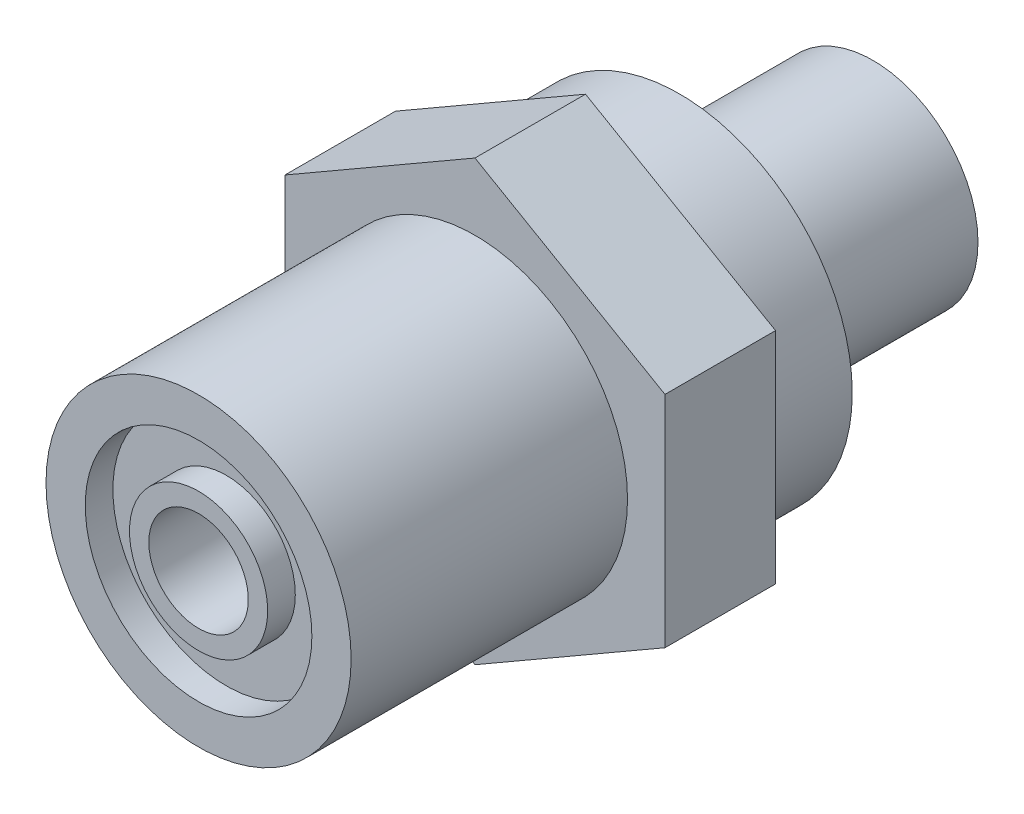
ISO-10303-21;
HEADER;
FILE_DESCRIPTION(('STEP AP214'),'2;1');
FILE_NAME('part.step','',(''),(''),'','','');
FILE_SCHEMA(('AUTOMOTIVE_DESIGN { 1 0 10303 214 1 1 1 1 }'));
ENDSEC;
DATA;
#1=APPLICATION_CONTEXT('core data for automotive mechanical design processes');
#2=APPLICATION_PROTOCOL_DEFINITION('international standard','automotive_design',2000,#1);
#3=PRODUCT_CONTEXT('',#1,'mechanical');
#4=PRODUCT('Part','Part','',(#3));
#5=PRODUCT_RELATED_PRODUCT_CATEGORY('part','',(#4));
#6=PRODUCT_DEFINITION_FORMATION('','',#4);
#7=PRODUCT_DEFINITION_CONTEXT('part definition',#1,'design');
#8=PRODUCT_DEFINITION('design','',#6,#7);
#9=PRODUCT_DEFINITION_SHAPE('','',#8);
#10=(LENGTH_UNIT() NAMED_UNIT(*) SI_UNIT(.MILLI.,.METRE.));
#11=(NAMED_UNIT(*) PLANE_ANGLE_UNIT() SI_UNIT($,.RADIAN.));
#12=(NAMED_UNIT(*) SI_UNIT($,.STERADIAN.) SOLID_ANGLE_UNIT());
#13=UNCERTAINTY_MEASURE_WITH_UNIT(LENGTH_MEASURE(1.E-05),#10,'distance_accuracy_value','');
#14=(GEOMETRIC_REPRESENTATION_CONTEXT(3) GLOBAL_UNCERTAINTY_ASSIGNED_CONTEXT((#13)) GLOBAL_UNIT_ASSIGNED_CONTEXT((#10,
#11,#12)) REPRESENTATION_CONTEXT('',''));
#15=CARTESIAN_POINT('',(0.,0.,0.));
#16=DIRECTION('',(0.,0.,1.));
#17=DIRECTION('',(1.,0.,0.));
#18=AXIS2_PLACEMENT_3D('',#15,#16,#17);
#19=CARTESIAN_POINT('',(0.,0.,30.9879999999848));
#20=DIRECTION('',(0.,0.,1.));
#21=DIRECTION('',(1.,0.,0.));
#22=AXIS2_PLACEMENT_3D('',#19,#20,#21);
#23=PLANE('',#22);
#24=CARTESIAN_POINT('',(0.,0.,30.9879999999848));
#25=DIRECTION('',(0.,0.,-1.));
#26=DIRECTION('',(-1.,0.,0.));
#27=AXIS2_PLACEMENT_3D('',#24,#25,#26);
#28=CIRCLE('',#27,2.286);
#29=CARTESIAN_POINT('',(-2.28599999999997,0.,30.9879999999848));
#30=VERTEX_POINT('',#29);
#31=EDGE_CURVE('E111',#30,#30,#28,.T.);
#32=ORIENTED_EDGE('',*,*,#31,.T.);
#33=EDGE_LOOP('',(#32));
#34=FACE_BOUND('',#33,.T.);
#35=CARTESIAN_POINT('',(0.,0.,30.9879999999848));
#36=DIRECTION('',(0.,0.,1.));
#37=DIRECTION('',(1.,0.,0.));
#38=AXIS2_PLACEMENT_3D('',#35,#36,#37);
#39=CIRCLE('',#38,3.175);
#40=CARTESIAN_POINT('',(3.17500000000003,0.,30.9879999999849));
#41=VERTEX_POINT('',#40);
#42=EDGE_CURVE('E210',#41,#41,#39,.T.);
#43=ORIENTED_EDGE('',*,*,#42,.T.);
#44=EDGE_LOOP('',(#43));
#45=FACE_BOUND('',#44,.T.);
#46=ADVANCED_FACE('F30',(#34,#45),#23,.T.);
#47=CARTESIAN_POINT('',(-8.73124185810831,-5.04098718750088,18.2879999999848));
#48=DIRECTION('',(0.,0.,-1.));
#49=DIRECTION('',(-1.,0.,0.));
#50=AXIS2_PLACEMENT_3D('',#47,#48,#49);
#51=PLANE('',#50);
#52=DIRECTION('',(0.,-1.00000000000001,0.));
#53=VECTOR('',#52,1.);
#54=CARTESIAN_POINT('',(-8.73124185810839,5.04098718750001,18.2879999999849));
#55=LINE('',#54,#53);
#56=CARTESIAN_POINT('',(-8.73124185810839,5.04098718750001,18.2879999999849));
#57=VERTEX_POINT('',#56);
#58=CARTESIAN_POINT('',(-8.73124185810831,-5.04098718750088,18.2879999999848));
#59=VERTEX_POINT('',#58);
#60=EDGE_CURVE('E122',#57,#59,#55,.T.);
#61=ORIENTED_EDGE('',*,*,#60,.T.);
#62=DIRECTION('',(0.866025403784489,-0.499999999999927,0.));
#63=VECTOR('',#62,1.);
#64=CARTESIAN_POINT('',(4.07094599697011E-06,-10.0819743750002,18.2879999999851));
#65=LINE('',#64,#63);
#66=CARTESIAN_POINT('',(4.07094599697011E-06,-10.0819743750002,18.2879999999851));
#67=VERTEX_POINT('',#66);
#68=EDGE_CURVE('E99',#59,#67,#65,.T.);
#69=ORIENTED_EDGE('',*,*,#68,.T.);
#70=DIRECTION('',(0.866025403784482,0.499999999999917,0.));
#71=VECTOR('',#70,1.);
#72=CARTESIAN_POINT('',(4.07094599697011E-06,-10.0819743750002,18.2879999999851));
#73=LINE('',#72,#71);
#74=CARTESIAN_POINT('',(8.7312500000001,-5.04098718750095,18.2879999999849));
#75=VERTEX_POINT('',#74);
#76=EDGE_CURVE('E125',#67,#75,#73,.T.);
#77=ORIENTED_EDGE('',*,*,#76,.T.);
#78=DIRECTION('',(0.,1.00000000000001,0.));
#79=VECTOR('',#78,1.);
#80=CARTESIAN_POINT('',(8.73125000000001,5.04098718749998,18.2879999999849));
#81=LINE('',#80,#79);
#82=CARTESIAN_POINT('',(8.73125000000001,5.04098718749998,18.2879999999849));
#83=VERTEX_POINT('',#82);
#84=EDGE_CURVE('E127',#75,#83,#81,.T.);
#85=ORIENTED_EDGE('',*,*,#84,.T.);
#86=DIRECTION('',(-0.866025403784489,0.499999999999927,0.));
#87=VECTOR('',#86,1.);
#88=CARTESIAN_POINT('',(4.07094583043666E-06,10.0819743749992,18.2879999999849));
#89=LINE('',#88,#87);
#90=CARTESIAN_POINT('',(4.07094583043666E-06,10.0819743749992,18.2879999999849));
#91=VERTEX_POINT('',#90);
#92=EDGE_CURVE('E50',#83,#91,#89,.T.);
#93=ORIENTED_EDGE('',*,*,#92,.T.);
#94=DIRECTION('',(-0.866025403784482,-0.499999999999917,0.));
#95=VECTOR('',#94,1.);
#96=CARTESIAN_POINT('',(4.07094583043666E-06,10.0819743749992,18.2879999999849));
#97=LINE('',#96,#95);
#98=EDGE_CURVE('E45',#91,#57,#97,.T.);
#99=ORIENTED_EDGE('',*,*,#98,.T.);
#100=EDGE_LOOP('',(#61,#69,#77,#85,#93,#99));
#101=FACE_BOUND('',#100,.T.);
#102=CARTESIAN_POINT('',(2.08166817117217E-13,0.,18.2879999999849));
#103=DIRECTION('',(0.,0.,-1.));
#104=DIRECTION('',(-1.,0.,0.));
#105=AXIS2_PLACEMENT_3D('',#102,#103,#104);
#106=CIRCLE('',#105,7.0104);
#107=CARTESIAN_POINT('',(-7.01039999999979,1.37227518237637E-13,18.2879999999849));
#108=VERTEX_POINT('',#107);
#109=EDGE_CURVE('E11',#108,#108,#106,.F.);
#110=ORIENTED_EDGE('',*,*,#109,.F.);
#111=EDGE_LOOP('',(#110));
#112=FACE_BOUND('',#111,.T.);
#113=ADVANCED_FACE('F157',(#101,#112),#51,.F.);
#114=CARTESIAN_POINT('',(0.,0.,8.89));
#115=DIRECTION('',(0.,0.,-1.));
#116=DIRECTION('',(-1.,0.,0.));
#117=AXIS2_PLACEMENT_3D('',#114,#115,#116);
#118=CYLINDRICAL_SURFACE('',#117,4.826);
#119=CARTESIAN_POINT('',(0.,0.,8.89));
#120=DIRECTION('',(0.,0.,1.));
#121=DIRECTION('',(1.,0.,0.));
#122=AXIS2_PLACEMENT_3D('',#119,#120,#121);
#123=CIRCLE('',#122,4.826);
#124=CARTESIAN_POINT('',(4.826,0.,8.89));
#125=VERTEX_POINT('',#124);
#126=EDGE_CURVE('E38',#125,#125,#123,.T.);
#127=ORIENTED_EDGE('',*,*,#126,.F.);
#128=EDGE_LOOP('',(#127));
#129=FACE_BOUND('',#128,.T.);
#130=CARTESIAN_POINT('',(0.,0.,0.));
#131=DIRECTION('',(0.,0.,1.));
#132=DIRECTION('',(1.,0.,0.));
#133=AXIS2_PLACEMENT_3D('',#130,#131,#132);
#134=CIRCLE('',#133,4.826);
#135=CARTESIAN_POINT('',(4.826,0.,0.));
#136=VERTEX_POINT('',#135);
#137=EDGE_CURVE('E147',#136,#136,#134,.T.);
#138=ORIENTED_EDGE('',*,*,#137,.T.);
#139=EDGE_LOOP('',(#138));
#140=FACE_BOUND('',#139,.T.);
#141=ADVANCED_FACE('F32',(#129,#140),#118,.T.);
#142=CARTESIAN_POINT('',(0.,0.,0.));
#143=DIRECTION('',(0.,0.,1.));
#144=DIRECTION('',(1.,0.,0.));
#145=AXIS2_PLACEMENT_3D('',#142,#143,#144);
#146=PLANE('',#145);
#147=CARTESIAN_POINT('',(0.,0.,0.));
#148=DIRECTION('',(0.,0.,-1.));
#149=DIRECTION('',(-1.,0.,0.));
#150=AXIS2_PLACEMENT_3D('',#147,#148,#149);
#151=CIRCLE('',#150,2.286);
#152=CARTESIAN_POINT('',(-2.28599999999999,0.,0.));
#153=VERTEX_POINT('',#152);
#154=EDGE_CURVE('E207',#153,#153,#151,.T.);
#155=ORIENTED_EDGE('',*,*,#154,.F.);
#156=EDGE_LOOP('',(#155));
#157=FACE_BOUND('',#156,.T.);
#158=ORIENTED_EDGE('',*,*,#137,.F.);
#159=EDGE_LOOP('',(#158));
#160=FACE_BOUND('',#159,.T.);
#161=ADVANCED_FACE('F156',(#157,#160),#146,.F.);
#162=CARTESIAN_POINT('',(0.,0.,8.89));
#163=DIRECTION('',(0.,0.,1.));
#164=DIRECTION('',(1.,0.,0.));
#165=AXIS2_PLACEMENT_3D('',#162,#163,#164);
#166=PLANE('',#165);
#167=CARTESIAN_POINT('',(0.,0.,8.89));
#168=DIRECTION('',(0.,0.,1.));
#169=DIRECTION('',(1.,0.,0.));
#170=AXIS2_PLACEMENT_3D('',#167,#168,#169);
#171=CIRCLE('',#170,7.9375);
#172=CARTESIAN_POINT('',(7.9375,0.,8.89));
#173=VERTEX_POINT('',#172);
#174=EDGE_CURVE('E102',#173,#173,#171,.T.);
#175=ORIENTED_EDGE('',*,*,#174,.F.);
#176=EDGE_LOOP('',(#175));
#177=FACE_BOUND('',#176,.T.);
#178=ORIENTED_EDGE('',*,*,#126,.T.);
#179=EDGE_LOOP('',(#178));
#180=FACE_BOUND('',#179,.T.);
#181=ADVANCED_FACE('F152',(#177,#180),#166,.F.);
#182=CARTESIAN_POINT('',(0.,0.,13.208));
#183=DIRECTION('',(0.,0.,-1.));
#184=DIRECTION('',(-1.,0.,0.));
#185=AXIS2_PLACEMENT_3D('',#182,#183,#184);
#186=CYLINDRICAL_SURFACE('',#185,7.9375);
#187=CARTESIAN_POINT('',(0.,0.,13.208));
#188=DIRECTION('',(0.,0.,1.));
#189=DIRECTION('',(1.,0.,0.));
#190=AXIS2_PLACEMENT_3D('',#187,#188,#189);
#191=CIRCLE('',#190,7.9375);
#192=CARTESIAN_POINT('',(7.9375,0.,13.208));
#193=VERTEX_POINT('',#192);
#194=EDGE_CURVE('E144',#193,#193,#191,.T.);
#195=ORIENTED_EDGE('',*,*,#194,.F.);
#196=EDGE_LOOP('',(#195));
#197=FACE_BOUND('',#196,.T.);
#198=ORIENTED_EDGE('',*,*,#174,.T.);
#199=EDGE_LOOP('',(#198));
#200=FACE_BOUND('',#199,.T.);
#201=ADVANCED_FACE('F165',(#197,#200),#186,.T.);
#202=CARTESIAN_POINT('',(-8.73124185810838,-5.04098718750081,13.2079999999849));
#203=DIRECTION('',(0.,0.,-1.));
#204=DIRECTION('',(-1.,0.,0.));
#205=AXIS2_PLACEMENT_3D('',#202,#203,#204);
#206=PLANE('',#205);
#207=DIRECTION('',(0.,-1.00000000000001,0.));
#208=VECTOR('',#207,1.);
#209=CARTESIAN_POINT('',(-8.73124185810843,5.04098718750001,13.207999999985));
#210=LINE('',#209,#208);
#211=CARTESIAN_POINT('',(-8.73124185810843,5.04098718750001,13.207999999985));
#212=VERTEX_POINT('',#211);
#213=CARTESIAN_POINT('',(-8.73124185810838,-5.04098718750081,13.2079999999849));
#214=VERTEX_POINT('',#213);
#215=EDGE_CURVE('E89',#212,#214,#210,.T.);
#216=ORIENTED_EDGE('',*,*,#215,.F.);
#217=DIRECTION('',(-0.866025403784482,-0.499999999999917,0.));
#218=VECTOR('',#217,1.);
#219=CARTESIAN_POINT('',(4.07094580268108E-06,10.0819743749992,13.2079999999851));
#220=LINE('',#219,#218);
#221=CARTESIAN_POINT('',(4.07094580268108E-06,10.0819743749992,13.2079999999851));
#222=VERTEX_POINT('',#221);
#223=EDGE_CURVE('E120',#222,#212,#220,.T.);
#224=ORIENTED_EDGE('',*,*,#223,.F.);
#225=DIRECTION('',(-0.866025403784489,0.499999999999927,0.));
#226=VECTOR('',#225,1.);
#227=CARTESIAN_POINT('',(4.07094580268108E-06,10.0819743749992,13.2079999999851));
#228=LINE('',#227,#226);
#229=CARTESIAN_POINT('',(8.73125000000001,5.04098718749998,13.2079999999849));
#230=VERTEX_POINT('',#229);
#231=EDGE_CURVE('E118',#230,#222,#228,.T.);
#232=ORIENTED_EDGE('',*,*,#231,.F.);
#233=DIRECTION('',(0.,1.00000000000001,0.));
#234=VECTOR('',#233,1.);
#235=CARTESIAN_POINT('',(8.73125000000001,5.04098718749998,13.2079999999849));
#236=LINE('',#235,#234);
#237=CARTESIAN_POINT('',(8.73125000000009,-5.04098718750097,13.207999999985));
#238=VERTEX_POINT('',#237);
#239=EDGE_CURVE('E116',#238,#230,#236,.T.);
#240=ORIENTED_EDGE('',*,*,#239,.F.);
#241=DIRECTION('',(0.866025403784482,0.499999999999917,0.));
#242=VECTOR('',#241,1.);
#243=CARTESIAN_POINT('',(4.07094594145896E-06,-10.0819743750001,13.2079999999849));
#244=LINE('',#243,#242);
#245=CARTESIAN_POINT('',(4.07094594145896E-06,-10.0819743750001,13.2079999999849));
#246=VERTEX_POINT('',#245);
#247=EDGE_CURVE('E91',#246,#238,#244,.T.);
#248=ORIENTED_EDGE('',*,*,#247,.F.);
#249=DIRECTION('',(0.866025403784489,-0.499999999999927,0.));
#250=VECTOR('',#249,1.);
#251=CARTESIAN_POINT('',(4.07094594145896E-06,-10.0819743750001,13.2079999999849));
#252=LINE('',#251,#250);
#253=EDGE_CURVE('E83',#214,#246,#252,.T.);
#254=ORIENTED_EDGE('',*,*,#253,.F.);
#255=EDGE_LOOP('',(#216,#224,#232,#240,#248,#254));
#256=FACE_BOUND('',#255,.T.);
#257=ORIENTED_EDGE('',*,*,#194,.T.);
#258=EDGE_LOOP('',(#257));
#259=FACE_BOUND('',#258,.T.);
#260=ADVANCED_FACE('F85',(#256,#259),#206,.T.);
#261=CARTESIAN_POINT('',(-8.73124185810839,5.04098718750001,18.2879999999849));
#262=DIRECTION('',(1.,0.,0.));
#263=DIRECTION('',(0.,0.,-1.));
#264=AXIS2_PLACEMENT_3D('',#261,#262,#263);
#265=PLANE('',#264);
#266=ORIENTED_EDGE('',*,*,#215,.T.);
#267=DIRECTION('',(0.,0.,-1.));
#268=VECTOR('',#267,1.);
#269=CARTESIAN_POINT('',(-8.73124185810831,-5.04098718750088,18.2879999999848));
#270=LINE('',#269,#268);
#271=EDGE_CURVE('E97',#59,#214,#270,.T.);
#272=ORIENTED_EDGE('',*,*,#271,.F.);
#273=ORIENTED_EDGE('',*,*,#60,.F.);
#274=DIRECTION('',(0.,0.,-1.));
#275=VECTOR('',#274,1.);
#276=CARTESIAN_POINT('',(-8.73124185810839,5.04098718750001,18.2879999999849));
#277=LINE('',#276,#275);
#278=EDGE_CURVE('E107',#57,#212,#277,.T.);
#279=ORIENTED_EDGE('',*,*,#278,.T.);
#280=EDGE_LOOP('',(#266,#272,#273,#279));
#281=FACE_BOUND('',#280,.T.);
#282=ADVANCED_FACE('F106',(#281),#265,.F.);
#283=CARTESIAN_POINT('',(4.07094599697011E-06,-10.0819743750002,18.2879999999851));
#284=DIRECTION('',(0.499999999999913,0.86602540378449,0.));
#285=DIRECTION('',(-0.866025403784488,0.499999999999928,0.));
#286=AXIS2_PLACEMENT_3D('',#283,#284,#285);
#287=PLANE('',#286);
#288=ORIENTED_EDGE('',*,*,#253,.T.);
#289=DIRECTION('',(0.,0.,-1.));
#290=VECTOR('',#289,1.);
#291=CARTESIAN_POINT('',(4.07094599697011E-06,-10.0819743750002,18.2879999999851));
#292=LINE('',#291,#290);
#293=EDGE_CURVE('E103',#67,#246,#292,.T.);
#294=ORIENTED_EDGE('',*,*,#293,.F.);
#295=ORIENTED_EDGE('',*,*,#68,.F.);
#296=ORIENTED_EDGE('',*,*,#271,.T.);
#297=EDGE_LOOP('',(#288,#294,#295,#296));
#298=FACE_BOUND('',#297,.T.);
#299=ADVANCED_FACE('F98',(#298),#287,.F.);
#300=CARTESIAN_POINT('',(4.07094599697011E-06,-10.0819743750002,18.2879999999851));
#301=DIRECTION('',(-0.499999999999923,0.866025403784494,0.));
#302=DIRECTION('',(-0.866025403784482,-0.499999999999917,0.));
#303=AXIS2_PLACEMENT_3D('',#300,#301,#302);
#304=PLANE('',#303);
#305=ORIENTED_EDGE('',*,*,#247,.T.);
#306=DIRECTION('',(0.,0.,-1.));
#307=VECTOR('',#306,1.);
#308=CARTESIAN_POINT('',(8.7312500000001,-5.04098718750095,18.2879999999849));
#309=LINE('',#308,#307);
#310=EDGE_CURVE('E138',#75,#238,#309,.T.);
#311=ORIENTED_EDGE('',*,*,#310,.F.);
#312=ORIENTED_EDGE('',*,*,#76,.F.);
#313=ORIENTED_EDGE('',*,*,#293,.T.);
#314=EDGE_LOOP('',(#305,#311,#312,#313));
#315=FACE_BOUND('',#314,.T.);
#316=ADVANCED_FACE('F282',(#315),#304,.F.);
#317=CARTESIAN_POINT('',(8.73125000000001,5.04098718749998,18.2879999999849));
#318=DIRECTION('',(-1.,0.,0.));
#319=DIRECTION('',(0.,0.,1.));
#320=AXIS2_PLACEMENT_3D('',#317,#318,#319);
#321=PLANE('',#320);
#322=ORIENTED_EDGE('',*,*,#239,.T.);
#323=DIRECTION('',(0.,0.,-1.));
#324=VECTOR('',#323,1.);
#325=CARTESIAN_POINT('',(8.73125000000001,5.04098718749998,18.2879999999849));
#326=LINE('',#325,#324);
#327=EDGE_CURVE('E135',#83,#230,#326,.T.);
#328=ORIENTED_EDGE('',*,*,#327,.F.);
#329=ORIENTED_EDGE('',*,*,#84,.F.);
#330=ORIENTED_EDGE('',*,*,#310,.T.);
#331=EDGE_LOOP('',(#322,#328,#329,#330));
#332=FACE_BOUND('',#331,.T.);
#333=ADVANCED_FACE('F274',(#332),#321,.F.);
#334=CARTESIAN_POINT('',(4.07094583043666E-06,10.0819743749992,18.2879999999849));
#335=DIRECTION('',(-0.499999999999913,-0.86602540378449,0.));
#336=DIRECTION('',(0.866025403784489,-0.499999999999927,0.));
#337=AXIS2_PLACEMENT_3D('',#334,#335,#336);
#338=PLANE('',#337);
#339=ORIENTED_EDGE('',*,*,#231,.T.);
#340=DIRECTION('',(0.,0.,-1.));
#341=VECTOR('',#340,1.);
#342=CARTESIAN_POINT('',(4.07094583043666E-06,10.0819743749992,18.2879999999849));
#343=LINE('',#342,#341);
#344=EDGE_CURVE('E132',#91,#222,#343,.T.);
#345=ORIENTED_EDGE('',*,*,#344,.F.);
#346=ORIENTED_EDGE('',*,*,#92,.F.);
#347=ORIENTED_EDGE('',*,*,#327,.T.);
#348=EDGE_LOOP('',(#339,#345,#346,#347));
#349=FACE_BOUND('',#348,.T.);
#350=ADVANCED_FACE('F266',(#349),#338,.F.);
#351=CARTESIAN_POINT('',(4.07094583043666E-06,10.0819743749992,18.2879999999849));
#352=DIRECTION('',(0.499999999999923,-0.866025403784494,0.));
#353=DIRECTION('',(0.866025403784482,0.499999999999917,0.));
#354=AXIS2_PLACEMENT_3D('',#351,#352,#353);
#355=PLANE('',#354);
#356=ORIENTED_EDGE('',*,*,#223,.T.);
#357=ORIENTED_EDGE('',*,*,#278,.F.);
#358=ORIENTED_EDGE('',*,*,#98,.F.);
#359=ORIENTED_EDGE('',*,*,#344,.T.);
#360=EDGE_LOOP('',(#356,#357,#358,#359));
#361=FACE_BOUND('',#360,.T.);
#362=ADVANCED_FACE('F192',(#361),#355,.F.);
#363=CARTESIAN_POINT('',(0.,0.,30.9879999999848));
#364=DIRECTION('',(0.,0.,-1.));
#365=DIRECTION('',(-1.,0.,0.));
#366=AXIS2_PLACEMENT_3D('',#363,#364,#365);
#367=CYLINDRICAL_SURFACE('',#366,7.0104);
#368=CARTESIAN_POINT('',(0.,0.,30.9879999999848));
#369=DIRECTION('',(0.,0.,1.));
#370=DIRECTION('',(1.,0.,0.));
#371=AXIS2_PLACEMENT_3D('',#368,#369,#370);
#372=CIRCLE('',#371,7.0104);
#373=CARTESIAN_POINT('',(7.01040000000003,0.,30.9879999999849));
#374=VERTEX_POINT('',#373);
#375=EDGE_CURVE('E108',#374,#374,#372,.T.);
#376=ORIENTED_EDGE('',*,*,#375,.F.);
#377=EDGE_LOOP('',(#376));
#378=FACE_BOUND('',#377,.T.);
#379=ORIENTED_EDGE('',*,*,#109,.T.);
#380=EDGE_LOOP('',(#379));
#381=FACE_BOUND('',#380,.T.);
#382=ADVANCED_FACE('F184',(#378,#381),#367,.T.);
#383=CARTESIAN_POINT('',(0.,0.,30.9879999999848));
#384=DIRECTION('',(0.,0.,1.));
#385=DIRECTION('',(1.,0.,0.));
#386=AXIS2_PLACEMENT_3D('',#383,#384,#385);
#387=CIRCLE('',#386,5.207);
#388=CARTESIAN_POINT('',(5.20700000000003,0.,30.9879999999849));
#389=VERTEX_POINT('',#388);
#390=EDGE_CURVE('E197',#389,#389,#387,.T.);
#391=ORIENTED_EDGE('',*,*,#390,.F.);
#392=EDGE_LOOP('',(#391));
#393=FACE_BOUND('',#392,.T.);
#394=ORIENTED_EDGE('',*,*,#375,.T.);
#395=EDGE_LOOP('',(#394));
#396=FACE_BOUND('',#395,.T.);
#397=ADVANCED_FACE('F173',(#393,#396),#23,.T.);
#398=CARTESIAN_POINT('',(0.,0.,30.9879999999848));
#399=DIRECTION('',(0.,0.,-1.));
#400=DIRECTION('',(-1.,0.,0.));
#401=AXIS2_PLACEMENT_3D('',#398,#399,#400);
#402=CYLINDRICAL_SURFACE('',#401,2.286);
#403=CARTESIAN_POINT('',(-2.28599999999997,0.,30.9879999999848));
#404=CARTESIAN_POINT('',(-2.28599999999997,0.,30.6652083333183));
#405=CARTESIAN_POINT('',(-2.28599999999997,0.,30.3424166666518));
#406=CARTESIAN_POINT('',(-2.28599999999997,0.,29.6968333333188));
#407=CARTESIAN_POINT('',(-2.28599999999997,0.,29.3740416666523));
#408=CARTESIAN_POINT('',(-2.28599999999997,0.,28.7284583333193));
#409=CARTESIAN_POINT('',(-2.28599999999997,0.,28.4056666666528));
#410=CARTESIAN_POINT('',(-2.28599999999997,0.,27.7600833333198));
#411=CARTESIAN_POINT('',(-2.28599999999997,0.,27.4372916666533));
#412=CARTESIAN_POINT('',(-2.28599999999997,0.,26.7917083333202));
#413=CARTESIAN_POINT('',(-2.28599999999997,0.,26.4689166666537));
#414=CARTESIAN_POINT('',(-2.28599999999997,0.,25.8233333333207));
#415=CARTESIAN_POINT('',(-2.28599999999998,0.,25.5005416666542));
#416=CARTESIAN_POINT('',(-2.28599999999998,0.,24.8549583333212));
#417=CARTESIAN_POINT('',(-2.28599999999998,0.,24.5321666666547));
#418=CARTESIAN_POINT('',(-2.28599999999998,0.,23.8865833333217));
#419=CARTESIAN_POINT('',(-2.28599999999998,0.,23.5637916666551));
#420=CARTESIAN_POINT('',(-2.28599999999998,0.,22.9182083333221));
#421=CARTESIAN_POINT('',(-2.28599999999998,0.,22.5954166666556));
#422=CARTESIAN_POINT('',(-2.28599999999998,0.,21.9498333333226));
#423=CARTESIAN_POINT('',(-2.28599999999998,0.,21.6270416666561));
#424=CARTESIAN_POINT('',(-2.28599999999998,0.,20.9814583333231));
#425=CARTESIAN_POINT('',(-2.28599999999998,0.,20.6586666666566));
#426=CARTESIAN_POINT('',(-2.28599999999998,0.,20.0130833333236));
#427=CARTESIAN_POINT('',(-2.28599999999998,0.,19.690291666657));
#428=CARTESIAN_POINT('',(-2.28599999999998,0.,19.044708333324));
#429=CARTESIAN_POINT('',(-2.28599999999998,0.,18.7219166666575));
#430=CARTESIAN_POINT('',(-2.28599999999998,0.,18.0763333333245));
#431=CARTESIAN_POINT('',(-2.28599999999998,0.,17.753541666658));
#432=CARTESIAN_POINT('',(-2.28599999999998,0.,17.107958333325));
#433=CARTESIAN_POINT('',(-2.28599999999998,0.,16.7851666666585));
#434=CARTESIAN_POINT('',(-2.28599999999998,0.,16.1395833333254));
#435=CARTESIAN_POINT('',(-2.28599999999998,0.,15.8167916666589));
#436=CARTESIAN_POINT('',(-2.28599999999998,0.,15.1712083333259));
#437=CARTESIAN_POINT('',(-2.28599999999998,0.,14.8484166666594));
#438=CARTESIAN_POINT('',(-2.28599999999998,0.,14.2028333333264));
#439=CARTESIAN_POINT('',(-2.28599999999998,0.,13.8800416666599));
#440=CARTESIAN_POINT('',(-2.28599999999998,0.,13.2344583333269));
#441=CARTESIAN_POINT('',(-2.28599999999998,0.,12.9116666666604));
#442=CARTESIAN_POINT('',(-2.28599999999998,0.,12.2660833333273));
#443=CARTESIAN_POINT('',(-2.28599999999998,0.,11.9432916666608));
#444=CARTESIAN_POINT('',(-2.28599999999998,0.,11.2977083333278));
#445=CARTESIAN_POINT('',(-2.28599999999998,0.,10.9749166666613));
#446=CARTESIAN_POINT('',(-2.28599999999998,0.,10.3293333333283));
#447=CARTESIAN_POINT('',(-2.28599999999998,0.,10.0065416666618));
#448=CARTESIAN_POINT('',(-2.28599999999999,0.,9.36095833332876));
#449=CARTESIAN_POINT('',(-2.28599999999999,0.,9.03816666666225));
#450=CARTESIAN_POINT('',(-2.28599999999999,0.,8.39258333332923));
#451=CARTESIAN_POINT('',(-2.28599999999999,0.,8.06979166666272));
#452=CARTESIAN_POINT('',(-2.28599999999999,0.,7.42420833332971));
#453=CARTESIAN_POINT('',(-2.28599999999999,0.,7.1014166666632));
#454=CARTESIAN_POINT('',(-2.28599999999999,0.,6.45583333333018));
#455=CARTESIAN_POINT('',(-2.28599999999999,0.,6.13304166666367));
#456=CARTESIAN_POINT('',(-2.28599999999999,0.,5.48745833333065));
#457=CARTESIAN_POINT('',(-2.28599999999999,0.,5.16466666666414));
#458=CARTESIAN_POINT('',(-2.28599999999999,0.,4.51908333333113));
#459=CARTESIAN_POINT('',(-2.28599999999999,0.,4.19629166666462));
#460=CARTESIAN_POINT('',(-2.28599999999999,0.,3.5507083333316));
#461=CARTESIAN_POINT('',(-2.28599999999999,0.,3.22791666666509));
#462=CARTESIAN_POINT('',(-2.28599999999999,0.,2.58233333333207));
#463=CARTESIAN_POINT('',(-2.28599999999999,0.,2.25954166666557));
#464=CARTESIAN_POINT('',(-2.28599999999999,0.,1.61395833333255));
#465=CARTESIAN_POINT('',(-2.28599999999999,0.,1.29116666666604));
#466=CARTESIAN_POINT('',(-2.28599999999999,0.,0.64558333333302));
#467=CARTESIAN_POINT('',(-2.28599999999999,0.,0.322791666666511));
#468=CARTESIAN_POINT('',(-2.28599999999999,0.,0.));
#469=B_SPLINE_CURVE_WITH_KNOTS('',3,(#403,#404,#405,#406,#407,#408,#409,#410,#411,#412,#413,
#414,#415,#416,#417,#418,#419,#420,#421,#422,#423,#424,#425,#426,#427,#428,#429,#430,#431,#432,
#433,#434,#435,#436,#437,#438,#439,#440,#441,#442,#443,#444,#445,#446,#447,#448,#449,#450,#451,
#452,#453,#454,#455,#456,#457,#458,#459,#460,#461,#462,#463,#464,#465,#466,#467,#468),
.UNSPECIFIED.,.F.,.F.,(4,2,2,2,2,2,2,2,2,2,2,2,2,2,2,2,2,2,2,2,2,2,2,2,2,2,2,2,2,2,2,2,4),(0.,
0.968374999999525,1.93674999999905,2.90512499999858,3.8734999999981,4.84187499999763,
5.81024999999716,6.77862499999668,7.74699999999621,8.71537499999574,9.68374999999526,
10.6521249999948,11.6204999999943,12.5888749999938,13.5572499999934,14.5256249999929,
15.4939999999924,16.4623749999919,17.4307499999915,18.399124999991,19.3674999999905,
20.3358749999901,21.3042499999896,22.2726249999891,23.2409999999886,24.2093749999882,
25.1777499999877,26.1461249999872,27.1144999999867,28.0828749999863,29.0512499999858,
30.0196249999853,30.9879999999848),.UNSPECIFIED.);
#470=EDGE_CURVE('BSEAM183',#30,#153,#469,.T.);
#471=ORIENTED_EDGE('',*,*,#31,.F.);
#472=ORIENTED_EDGE('',*,*,#154,.T.);
#473=ORIENTED_EDGE('',*,*,#470,.T.);
#474=ORIENTED_EDGE('',*,*,#470,.F.);
#475=EDGE_LOOP('',(#471,#473,#472,#474));
#476=FACE_BOUND('',#475,.T.);
#477=ADVANCED_FACE('F183',(#476),#402,.F.);
#478=CARTESIAN_POINT('',(0.,0.,29.7179999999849));
#479=DIRECTION('',(0.,0.,1.));
#480=DIRECTION('',(1.,0.,0.));
#481=AXIS2_PLACEMENT_3D('',#478,#479,#480);
#482=CYLINDRICAL_SURFACE('',#481,5.207);
#483=CARTESIAN_POINT('',(0.,0.,29.7179999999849));
#484=DIRECTION('',(0.,0.,1.));
#485=DIRECTION('',(1.,0.,0.));
#486=AXIS2_PLACEMENT_3D('',#483,#484,#485);
#487=CIRCLE('',#486,5.207);
#488=CARTESIAN_POINT('',(5.20700000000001,0.,29.7179999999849));
#489=VERTEX_POINT('',#488);
#490=EDGE_CURVE('E203',#489,#489,#487,.T.);
#491=ORIENTED_EDGE('',*,*,#490,.F.);
#492=EDGE_LOOP('',(#491));
#493=FACE_BOUND('',#492,.T.);
#494=ORIENTED_EDGE('',*,*,#390,.T.);
#495=EDGE_LOOP('',(#494));
#496=FACE_BOUND('',#495,.T.);
#497=ADVANCED_FACE('F190',(#493,#496),#482,.F.);
#498=CARTESIAN_POINT('',(0.,0.,29.7179999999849));
#499=DIRECTION('',(0.,0.,1.));
#500=DIRECTION('',(1.,0.,0.));
#501=AXIS2_PLACEMENT_3D('',#498,#499,#500);
#502=PLANE('',#501);
#503=CARTESIAN_POINT('',(0.,0.,29.7179999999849));
#504=DIRECTION('',(0.,0.,1.));
#505=DIRECTION('',(1.,0.,0.));
#506=AXIS2_PLACEMENT_3D('',#503,#504,#505);
#507=CIRCLE('',#506,3.175);
#508=CARTESIAN_POINT('',(3.17500000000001,0.,29.7179999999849));
#509=VERTEX_POINT('',#508);
#510=EDGE_CURVE('E204',#509,#509,#507,.T.);
#511=ORIENTED_EDGE('',*,*,#510,.F.);
#512=EDGE_LOOP('',(#511));
#513=FACE_BOUND('',#512,.T.);
#514=ORIENTED_EDGE('',*,*,#490,.T.);
#515=EDGE_LOOP('',(#514));
#516=FACE_BOUND('',#515,.T.);
#517=ADVANCED_FACE('F222',(#513,#516),#502,.T.);
#518=CARTESIAN_POINT('',(0.,0.,29.7179999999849));
#519=DIRECTION('',(0.,0.,1.));
#520=DIRECTION('',(1.,0.,0.));
#521=AXIS2_PLACEMENT_3D('',#518,#519,#520);
#522=CYLINDRICAL_SURFACE('',#521,3.175);
#523=ORIENTED_EDGE('',*,*,#510,.T.);
#524=EDGE_LOOP('',(#523));
#525=FACE_BOUND('',#524,.T.);
#526=ORIENTED_EDGE('',*,*,#42,.F.);
#527=EDGE_LOOP('',(#526));
#528=FACE_BOUND('',#527,.T.);
#529=ADVANCED_FACE('F220',(#525,#528),#522,.T.);
#530=CLOSED_SHELL('',(#46,#113,#141,#161,#181,#201,#260,#282,#299,#316,#333,#350,#362,#382,#397,
#477,#497,#517,#529));
#531=MANIFOLD_SOLID_BREP('B2',#530);
#532=ADVANCED_BREP_SHAPE_REPRESENTATION('',(#18,#531),#14);
#533=SHAPE_DEFINITION_REPRESENTATION(#9,#532);
ENDSEC;
END-ISO-10303-21;
